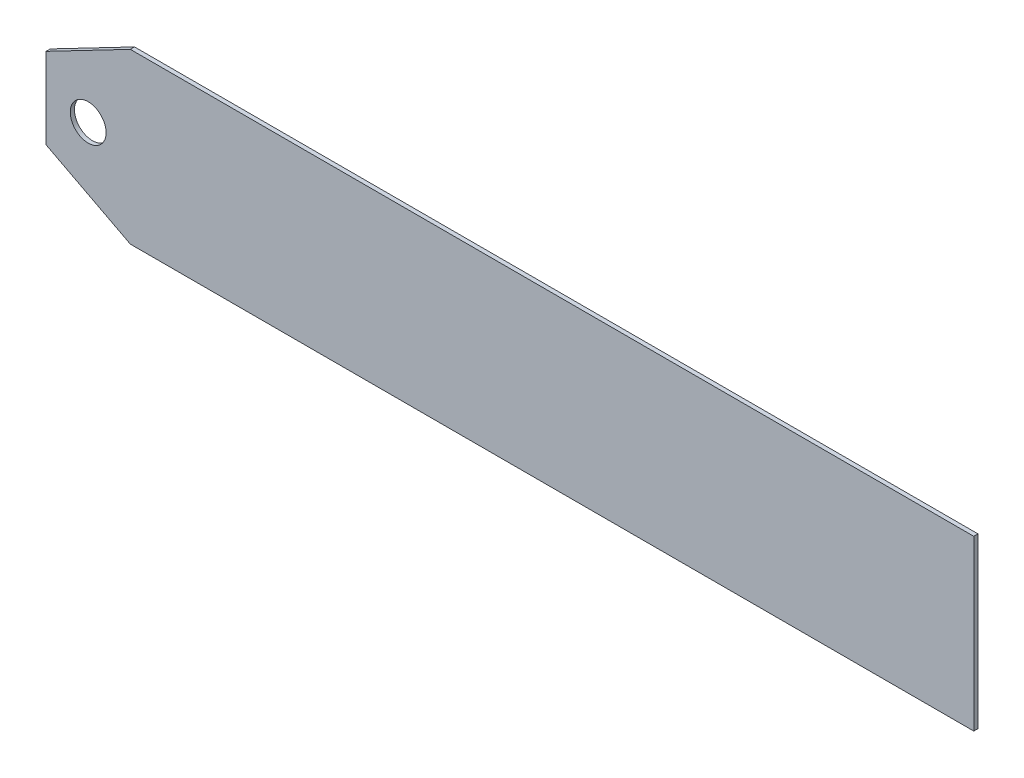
from build123d import *

# Parameters (mm, degrees)
SKETCH_1_R      = 4.25
EXTRUDE_1_DEPTH = 1


with BuildPart() as part:
    # Sketch 1 → Extrude 1 (new body)
    with BuildSketch(Plane.XY):
        Polygon((-20, 9.588658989), (-20, -9.588658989), (0, -20), (200, -20), (200, 20), (0, 20), align=None)
        with Locations((-10, 0)):
            Circle(SKETCH_1_R, mode=Mode.SUBTRACT)
    extrude(amount=EXTRUDE_1_DEPTH)


solid = part.part
